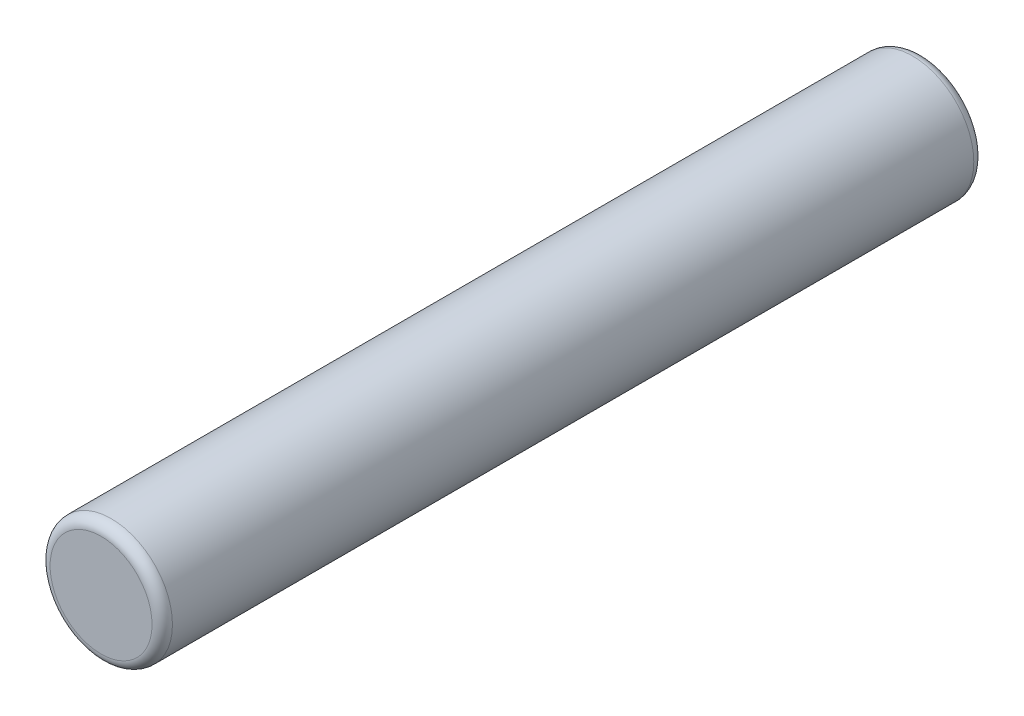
from build123d import *

# Parameters (mm, degrees)
SKETCH1_R           = 3
BOSS_EXTRUDE1_DEPTH = 40.3
FILLET1_R           = 0.5
FILLET2_R           = 0.5


with BuildPart() as part:
    # Sketch1 → Boss-Extrude1 (new body)
    with BuildSketch(Plane.XY):
        Circle(SKETCH1_R)
    extrude(amount=BOSS_EXTRUDE1_DEPTH)

    # Fillet1
    fillet1_edges = [part.edges().sort_by_distance(p)[0] for p in [
        (-3, 0, 0),
    ]]
    fillet(fillet1_edges, radius=FILLET1_R)

    # Fillet2
    fillet2_edges = [part.edges().sort_by_distance(p)[0] for p in [
        (-3, 0, 40.3),
    ]]
    fillet(fillet2_edges, radius=FILLET2_R)


solid = part.part
